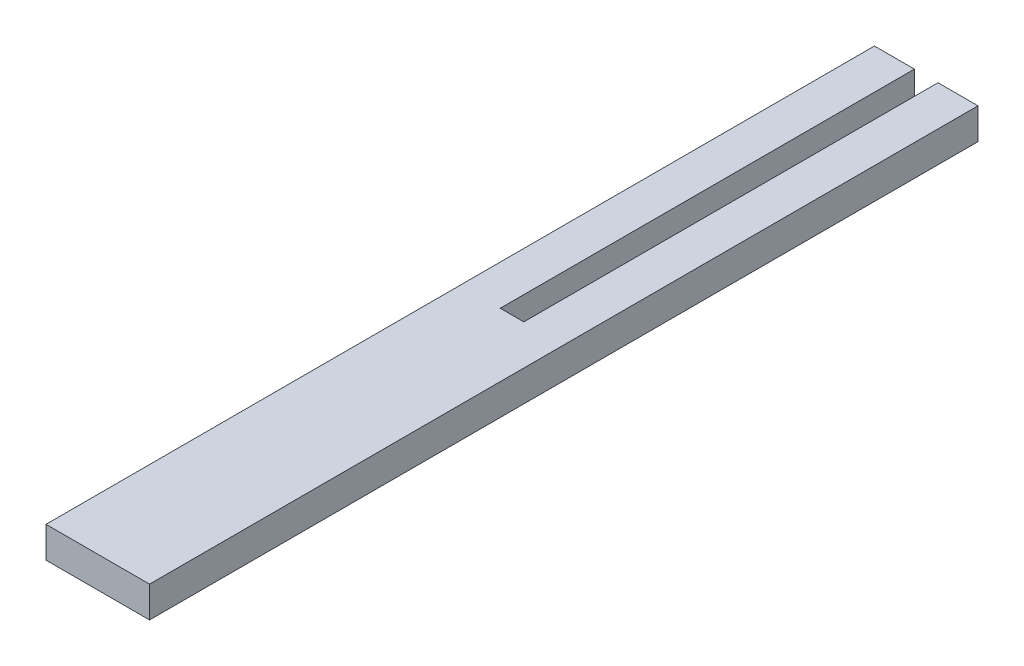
ISO-10303-21;
HEADER;
FILE_DESCRIPTION(('STEP AP214'),'2;1');
FILE_NAME('part.step','',(''),(''),'','','');
FILE_SCHEMA(('AUTOMOTIVE_DESIGN { 1 0 10303 214 1 1 1 1 }'));
ENDSEC;
DATA;
#1=APPLICATION_CONTEXT('core data for automotive mechanical design processes');
#2=APPLICATION_PROTOCOL_DEFINITION('international standard','automotive_design',2000,#1);
#3=PRODUCT_CONTEXT('',#1,'mechanical');
#4=PRODUCT('Part','Part','',(#3));
#5=PRODUCT_RELATED_PRODUCT_CATEGORY('part','',(#4));
#6=PRODUCT_DEFINITION_FORMATION('','',#4);
#7=PRODUCT_DEFINITION_CONTEXT('part definition',#1,'design');
#8=PRODUCT_DEFINITION('design','',#6,#7);
#9=PRODUCT_DEFINITION_SHAPE('','',#8);
#10=(LENGTH_UNIT() NAMED_UNIT(*) SI_UNIT(.MILLI.,.METRE.));
#11=(NAMED_UNIT(*) PLANE_ANGLE_UNIT() SI_UNIT($,.RADIAN.));
#12=(NAMED_UNIT(*) SI_UNIT($,.STERADIAN.) SOLID_ANGLE_UNIT());
#13=UNCERTAINTY_MEASURE_WITH_UNIT(LENGTH_MEASURE(1.E-05),#10,'distance_accuracy_value','');
#14=(GEOMETRIC_REPRESENTATION_CONTEXT(3) GLOBAL_UNCERTAINTY_ASSIGNED_CONTEXT((#13)) GLOBAL_UNIT_ASSIGNED_CONTEXT((#10,
#11,#12)) REPRESENTATION_CONTEXT('',''));
#15=CARTESIAN_POINT('',(0.,0.,0.));
#16=DIRECTION('',(0.,0.,1.));
#17=DIRECTION('',(1.,0.,0.));
#18=AXIS2_PLACEMENT_3D('',#15,#16,#17);
#19=CARTESIAN_POINT('',(-5.,-3.,-40.));
#20=DIRECTION('',(0.,0.,1.));
#21=DIRECTION('',(1.,0.,0.));
#22=AXIS2_PLACEMENT_3D('',#19,#20,#21);
#23=PLANE('',#22);
#24=DIRECTION('',(1.,0.,0.));
#25=VECTOR('',#24,1.);
#26=CARTESIAN_POINT('',(-5.,-3.,-40.));
#27=LINE('',#26,#25);
#28=CARTESIAN_POINT('',(1.14,-3.,-40.));
#29=VERTEX_POINT('',#28);
#30=CARTESIAN_POINT('',(5.,-3.,-40.));
#31=VERTEX_POINT('',#30);
#32=EDGE_CURVE('E91',#29,#31,#27,.T.);
#33=ORIENTED_EDGE('',*,*,#32,.F.);
#34=DIRECTION('',(0.,1.,0.));
#35=VECTOR('',#34,1.);
#36=CARTESIAN_POINT('',(1.14,-3.,-40.));
#37=LINE('',#36,#35);
#38=CARTESIAN_POINT('',(1.14,0.,-40.));
#39=VERTEX_POINT('',#38);
#40=EDGE_CURVE('E141',#29,#39,#37,.T.);
#41=ORIENTED_EDGE('',*,*,#40,.T.);
#42=DIRECTION('',(1.,0.,0.));
#43=VECTOR('',#42,1.);
#44=CARTESIAN_POINT('',(-5.,0.,-40.));
#45=LINE('',#44,#43);
#46=CARTESIAN_POINT('',(5.,0.,-40.));
#47=VERTEX_POINT('',#46);
#48=EDGE_CURVE('E144',#39,#47,#45,.T.);
#49=ORIENTED_EDGE('',*,*,#48,.T.);
#50=DIRECTION('',(0.,1.,0.));
#51=VECTOR('',#50,1.);
#52=CARTESIAN_POINT('',(5.,-3.,-40.));
#53=LINE('',#52,#51);
#54=EDGE_CURVE('E49',#31,#47,#53,.T.);
#55=ORIENTED_EDGE('',*,*,#54,.F.);
#56=EDGE_LOOP('',(#33,#41,#49,#55));
#57=FACE_BOUND('',#56,.T.);
#58=ADVANCED_FACE('F41',(#57),#23,.F.);
#59=CARTESIAN_POINT('',(-5.,0.,-40.));
#60=VERTEX_POINT('',#59);
#61=CARTESIAN_POINT('',(-1.14,0.,-40.));
#62=VERTEX_POINT('',#61);
#63=EDGE_CURVE('E153',#60,#62,#45,.T.);
#64=ORIENTED_EDGE('',*,*,#63,.T.);
#65=DIRECTION('',(0.,-1.,0.));
#66=VECTOR('',#65,1.);
#67=CARTESIAN_POINT('',(-1.14,-3.,-40.));
#68=LINE('',#67,#66);
#69=CARTESIAN_POINT('',(-1.14,-3.,-40.));
#70=VERTEX_POINT('',#69);
#71=EDGE_CURVE('E56',#62,#70,#68,.T.);
#72=ORIENTED_EDGE('',*,*,#71,.T.);
#73=CARTESIAN_POINT('',(-5.,-3.,-40.));
#74=VERTEX_POINT('',#73);
#75=EDGE_CURVE('E130',#74,#70,#27,.T.);
#76=ORIENTED_EDGE('',*,*,#75,.F.);
#77=DIRECTION('',(0.,1.,0.));
#78=VECTOR('',#77,1.);
#79=CARTESIAN_POINT('',(-5.,-3.,-40.));
#80=LINE('',#79,#78);
#81=EDGE_CURVE('E64',#74,#60,#80,.T.);
#82=ORIENTED_EDGE('',*,*,#81,.T.);
#83=EDGE_LOOP('',(#64,#72,#76,#82));
#84=FACE_BOUND('',#83,.T.);
#85=ADVANCED_FACE('F43',(#84),#23,.F.);
#86=CARTESIAN_POINT('',(5.,-3.,-40.));
#87=DIRECTION('',(-1.,0.,0.));
#88=DIRECTION('',(0.,0.,1.));
#89=AXIS2_PLACEMENT_3D('',#86,#87,#88);
#90=PLANE('',#89);
#91=DIRECTION('',(0.,0.,1.));
#92=VECTOR('',#91,1.);
#93=CARTESIAN_POINT('',(5.,0.,-40.));
#94=LINE('',#93,#92);
#95=CARTESIAN_POINT('',(5.00000000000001,0.,40.));
#96=VERTEX_POINT('',#95);
#97=EDGE_CURVE('E155',#47,#96,#94,.T.);
#98=ORIENTED_EDGE('',*,*,#97,.T.);
#99=DIRECTION('',(0.,1.,0.));
#100=VECTOR('',#99,1.);
#101=CARTESIAN_POINT('',(5.00000000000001,-3.,40.));
#102=LINE('',#101,#100);
#103=CARTESIAN_POINT('',(5.00000000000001,-3.,40.));
#104=VERTEX_POINT('',#103);
#105=EDGE_CURVE('E167',#104,#96,#102,.T.);
#106=ORIENTED_EDGE('',*,*,#105,.F.);
#107=DIRECTION('',(0.,0.,1.));
#108=VECTOR('',#107,1.);
#109=CARTESIAN_POINT('',(5.,-3.,-40.));
#110=LINE('',#109,#108);
#111=EDGE_CURVE('E146',#31,#104,#110,.T.);
#112=ORIENTED_EDGE('',*,*,#111,.F.);
#113=ORIENTED_EDGE('',*,*,#54,.T.);
#114=EDGE_LOOP('',(#98,#106,#112,#113));
#115=FACE_BOUND('',#114,.T.);
#116=ADVANCED_FACE('F171',(#115),#90,.F.);
#117=CARTESIAN_POINT('',(-4.99999999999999,-3.,40.));
#118=DIRECTION('',(0.,0.,1.));
#119=DIRECTION('',(1.,0.,0.));
#120=AXIS2_PLACEMENT_3D('',#117,#118,#119);
#121=PLANE('',#120);
#122=DIRECTION('',(1.,0.,0.));
#123=VECTOR('',#122,1.);
#124=CARTESIAN_POINT('',(-4.99999999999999,0.,40.));
#125=LINE('',#124,#123);
#126=CARTESIAN_POINT('',(-4.99999999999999,0.,40.));
#127=VERTEX_POINT('',#126);
#128=EDGE_CURVE('E158',#127,#96,#125,.T.);
#129=ORIENTED_EDGE('',*,*,#128,.F.);
#130=DIRECTION('',(0.,1.,0.));
#131=VECTOR('',#130,1.);
#132=CARTESIAN_POINT('',(-4.99999999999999,-3.,40.));
#133=LINE('',#132,#131);
#134=CARTESIAN_POINT('',(-4.99999999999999,-3.,40.));
#135=VERTEX_POINT('',#134);
#136=EDGE_CURVE('E165',#135,#127,#133,.T.);
#137=ORIENTED_EDGE('',*,*,#136,.F.);
#138=DIRECTION('',(1.,0.,0.));
#139=VECTOR('',#138,1.);
#140=CARTESIAN_POINT('',(-4.99999999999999,-3.,40.));
#141=LINE('',#140,#139);
#142=EDGE_CURVE('E148',#135,#104,#141,.T.);
#143=ORIENTED_EDGE('',*,*,#142,.T.);
#144=ORIENTED_EDGE('',*,*,#105,.T.);
#145=EDGE_LOOP('',(#129,#137,#143,#144));
#146=FACE_BOUND('',#145,.T.);
#147=ADVANCED_FACE('F181',(#146),#121,.T.);
#148=CARTESIAN_POINT('',(-5.,-3.,-40.));
#149=DIRECTION('',(-1.,0.,0.));
#150=DIRECTION('',(0.,0.,1.));
#151=AXIS2_PLACEMENT_3D('',#148,#149,#150);
#152=PLANE('',#151);
#153=DIRECTION('',(0.,0.,1.));
#154=VECTOR('',#153,1.);
#155=CARTESIAN_POINT('',(-5.,0.,-40.));
#156=LINE('',#155,#154);
#157=EDGE_CURVE('E161',#60,#127,#156,.T.);
#158=ORIENTED_EDGE('',*,*,#157,.F.);
#159=ORIENTED_EDGE('',*,*,#81,.F.);
#160=DIRECTION('',(0.,0.,1.));
#161=VECTOR('',#160,1.);
#162=CARTESIAN_POINT('',(-5.,-3.,-40.));
#163=LINE('',#162,#161);
#164=EDGE_CURVE('E151',#74,#135,#163,.T.);
#165=ORIENTED_EDGE('',*,*,#164,.T.);
#166=ORIENTED_EDGE('',*,*,#136,.T.);
#167=EDGE_LOOP('',(#158,#159,#165,#166));
#168=FACE_BOUND('',#167,.T.);
#169=ADVANCED_FACE('F183',(#168),#152,.T.);
#170=CARTESIAN_POINT('',(0.,-3.,0.));
#171=DIRECTION('',(0.,-1.,0.));
#172=DIRECTION('',(0.,0.,-1.));
#173=AXIS2_PLACEMENT_3D('',#170,#171,#172);
#174=PLANE('',#173);
#175=DIRECTION('',(0.,0.,-1.));
#176=VECTOR('',#175,1.);
#177=CARTESIAN_POINT('',(1.14,-3.,-80.));
#178=LINE('',#177,#176);
#179=CARTESIAN_POINT('',(1.14,-3.,0.));
#180=VERTEX_POINT('',#179);
#181=EDGE_CURVE('E131',#180,#29,#178,.T.);
#182=ORIENTED_EDGE('',*,*,#181,.T.);
#183=ORIENTED_EDGE('',*,*,#32,.T.);
#184=ORIENTED_EDGE('',*,*,#111,.T.);
#185=ORIENTED_EDGE('',*,*,#142,.F.);
#186=ORIENTED_EDGE('',*,*,#164,.F.);
#187=ORIENTED_EDGE('',*,*,#75,.T.);
#188=DIRECTION('',(0.,0.,1.));
#189=VECTOR('',#188,1.);
#190=CARTESIAN_POINT('',(-1.14000000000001,-3.,-80.));
#191=LINE('',#190,#189);
#192=CARTESIAN_POINT('',(-1.14,-3.,0.));
#193=VERTEX_POINT('',#192);
#194=EDGE_CURVE('E116',#70,#193,#191,.T.);
#195=ORIENTED_EDGE('',*,*,#194,.T.);
#196=DIRECTION('',(1.,0.,0.));
#197=VECTOR('',#196,1.);
#198=CARTESIAN_POINT('',(-1.14,-3.,0.));
#199=LINE('',#198,#197);
#200=EDGE_CURVE('E121',#193,#180,#199,.T.);
#201=ORIENTED_EDGE('',*,*,#200,.T.);
#202=EDGE_LOOP('',(#182,#183,#184,#185,#186,#187,#195,#201));
#203=FACE_BOUND('',#202,.T.);
#204=ADVANCED_FACE('F128',(#203),#174,.T.);
#205=CARTESIAN_POINT('',(0.,0.,0.));
#206=DIRECTION('',(0.,-1.,0.));
#207=DIRECTION('',(0.,0.,-1.));
#208=AXIS2_PLACEMENT_3D('',#205,#206,#207);
#209=PLANE('',#208);
#210=ORIENTED_EDGE('',*,*,#48,.F.);
#211=DIRECTION('',(0.,0.,-1.));
#212=VECTOR('',#211,1.);
#213=CARTESIAN_POINT('',(1.14,0.,-80.));
#214=LINE('',#213,#212);
#215=CARTESIAN_POINT('',(1.14,0.,0.));
#216=VERTEX_POINT('',#215);
#217=EDGE_CURVE('E136',#216,#39,#214,.T.);
#218=ORIENTED_EDGE('',*,*,#217,.F.);
#219=DIRECTION('',(1.,0.,0.));
#220=VECTOR('',#219,1.);
#221=CARTESIAN_POINT('',(-1.14,0.,0.));
#222=LINE('',#221,#220);
#223=CARTESIAN_POINT('',(-1.14,0.,0.));
#224=VERTEX_POINT('',#223);
#225=EDGE_CURVE('E133',#224,#216,#222,.T.);
#226=ORIENTED_EDGE('',*,*,#225,.F.);
#227=DIRECTION('',(0.,0.,-1.));
#228=VECTOR('',#227,1.);
#229=CARTESIAN_POINT('',(-1.14,0.,0.));
#230=LINE('',#229,#228);
#231=EDGE_CURVE('E11',#224,#62,#230,.T.);
#232=ORIENTED_EDGE('',*,*,#231,.T.);
#233=ORIENTED_EDGE('',*,*,#63,.F.);
#234=ORIENTED_EDGE('',*,*,#157,.T.);
#235=ORIENTED_EDGE('',*,*,#128,.T.);
#236=ORIENTED_EDGE('',*,*,#97,.F.);
#237=EDGE_LOOP('',(#210,#218,#226,#232,#233,#234,#235,#236));
#238=FACE_BOUND('',#237,.T.);
#239=ADVANCED_FACE('F178',(#238),#209,.F.);
#240=CARTESIAN_POINT('',(1.14,-3.,-80.));
#241=DIRECTION('',(1.,0.,0.));
#242=DIRECTION('',(0.,0.,-1.));
#243=AXIS2_PLACEMENT_3D('',#240,#241,#242);
#244=PLANE('',#243);
#245=ORIENTED_EDGE('',*,*,#181,.F.);
#246=DIRECTION('',(0.,1.,0.));
#247=VECTOR('',#246,1.);
#248=CARTESIAN_POINT('',(1.14,-3.,0.));
#249=LINE('',#248,#247);
#250=EDGE_CURVE('E120',#180,#216,#249,.T.);
#251=ORIENTED_EDGE('',*,*,#250,.T.);
#252=ORIENTED_EDGE('',*,*,#217,.T.);
#253=ORIENTED_EDGE('',*,*,#40,.F.);
#254=EDGE_LOOP('',(#245,#251,#252,#253));
#255=FACE_BOUND('',#254,.T.);
#256=ADVANCED_FACE('F201',(#255),#244,.F.);
#257=CARTESIAN_POINT('',(-1.14000000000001,-3.,-80.));
#258=DIRECTION('',(-1.,0.,0.));
#259=DIRECTION('',(0.,0.,1.));
#260=AXIS2_PLACEMENT_3D('',#257,#258,#259);
#261=PLANE('',#260);
#262=ORIENTED_EDGE('',*,*,#231,.F.);
#263=DIRECTION('',(0.,1.,0.));
#264=VECTOR('',#263,1.);
#265=CARTESIAN_POINT('',(-1.14,-3.,0.));
#266=LINE('',#265,#264);
#267=EDGE_CURVE('E112',#193,#224,#266,.T.);
#268=ORIENTED_EDGE('',*,*,#267,.F.);
#269=ORIENTED_EDGE('',*,*,#194,.F.);
#270=ORIENTED_EDGE('',*,*,#71,.F.);
#271=EDGE_LOOP('',(#262,#268,#269,#270));
#272=FACE_BOUND('',#271,.T.);
#273=ADVANCED_FACE('F114',(#272),#261,.F.);
#274=CARTESIAN_POINT('',(-1.14,-3.,0.));
#275=DIRECTION('',(0.,0.,1.));
#276=DIRECTION('',(1.,0.,0.));
#277=AXIS2_PLACEMENT_3D('',#274,#275,#276);
#278=PLANE('',#277);
#279=ORIENTED_EDGE('',*,*,#225,.T.);
#280=ORIENTED_EDGE('',*,*,#250,.F.);
#281=ORIENTED_EDGE('',*,*,#200,.F.);
#282=ORIENTED_EDGE('',*,*,#267,.T.);
#283=EDGE_LOOP('',(#279,#280,#281,#282));
#284=FACE_BOUND('',#283,.T.);
#285=ADVANCED_FACE('F124',(#284),#278,.F.);
#286=CLOSED_SHELL('',(#58,#85,#116,#147,#169,#204,#239,#256,#273,#285));
#287=MANIFOLD_SOLID_BREP('B2',#286);
#288=ADVANCED_BREP_SHAPE_REPRESENTATION('',(#18,#287),#14);
#289=SHAPE_DEFINITION_REPRESENTATION(#9,#288);
ENDSEC;
END-ISO-10303-21;
